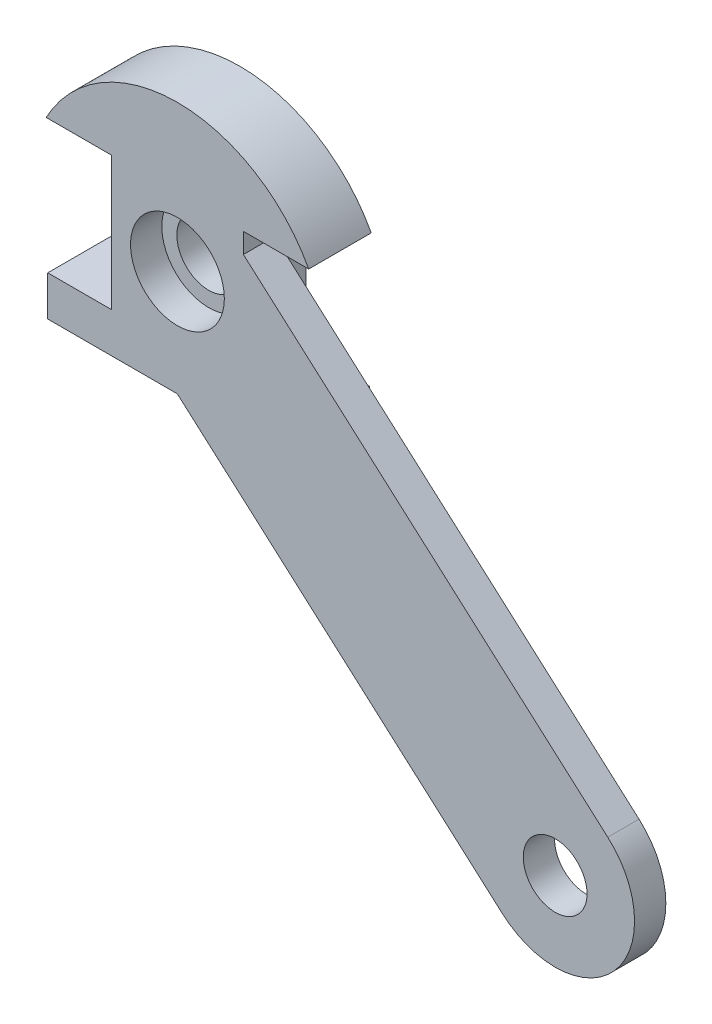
from build123d import *

# Parameters (mm, degrees)
BOSS_EXTRUDE2_DEPTH     = 10
CUT_EXTRUDE2_DEPTH      = 32.853215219
CUT_EXTRUDE2_DEPTH_BACK = 32.853215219
SKETCH4_R               = 5.1
BOSS_EXTRUDE3_DEPTH     = 5
SKETCH6_R               = 5
CUT_EXTRUDE3_DEPTH      = 99.704831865
SKETCH7_R               = 5.1
CUT_EXTRUDE4_DEPTH      = 99.704831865
SKETCH8_R               = 7.5
CUT_EXTRUDE5_DEPTH      = 5


with BuildPart() as part:
    # Sketch3 → Boss-Extrude2 (new body)
    with BuildSketch(Plane.XY):
        with BuildLine():
            Line((-20.74, -16.94245), (20.74, -16.94245))
            Line((20.74, -16.94245), (20.74, -10.5429))
            Line((20.74, -10.5429), (10.54169, -10.5429))
            Line((10.54169, -10.5429), (10.54169, 10.84581))
            Line((10.54169, 10.84581), (20.99169, 10.84581))
            ThreePointArc((20.99169, 10.84581), (0, 23.430242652), (-20.99169, 10.84581))
            Line((-20.99169, 10.84581), (-10.54169, 10.84581))
            Line((-10.54169, 10.84581), (-10.54169, -10.5429))
            Line((-10.54169, -10.5429), (-20.74, -10.5429))
            Line((-20.74, -10.5429), (-20.74, -16.94245))
        make_face()
    extrude(amount=BOSS_EXTRUDE2_DEPTH)

    # Sketch4 → Cut-Extrude2 (cut, two sides: drawn at the far end of the back side and taken through both)
    with BuildSketch(Plane.XY.offset(5).offset(-CUT_EXTRUDE2_DEPTH_BACK)):
        Circle(SKETCH4_R)
    extrude(amount=CUT_EXTRUDE2_DEPTH + CUT_EXTRUDE2_DEPTH_BACK, mode=Mode.SUBTRACT)

    # Sketch5 → Boss-Extrude3 (add)
    with BuildSketch(Plane.XY.offset(5)):
        with BuildLine():
            Line((8.858299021, 9.119782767), (68.814808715, -43.925256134))
            ThreePointArc((68.814808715, -43.925256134), (69.911271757, -61.852268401), (51.984259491, -62.948731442))
            Line((51.984259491, -62.948731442), (-7.972250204, -9.903692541))
            ThreePointArc((-7.972250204, -9.903692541), (-6.922429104, 6.12444792), (8.858299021, 9.119782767))
        make_face()
    extrude(amount=BOSS_EXTRUDE3_DEPTH)

    # Sketch6 → Cut-Extrude3 (cut, through all)
    with BuildSketch(Plane.XY.offset(5)):
        Circle(SKETCH6_R)
    extrude(amount=CUT_EXTRUDE3_DEPTH, mode=Mode.SUBTRACT)

    # Sketch7 → Cut-Extrude4 (cut, through all)
    with BuildSketch(Plane.XY.offset(5)):
        with Locations((60.399534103, -53.436993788)):
            Circle(SKETCH7_R)
    extrude(amount=CUT_EXTRUDE4_DEPTH, mode=Mode.SUBTRACT)

    # Sketch8 → Cut-Extrude5 (cut)
    with BuildSketch(Plane.XY.offset(5)):
        Circle(SKETCH8_R)
    extrude(amount=CUT_EXTRUDE5_DEPTH, mode=Mode.SUBTRACT)


solid = part.part
